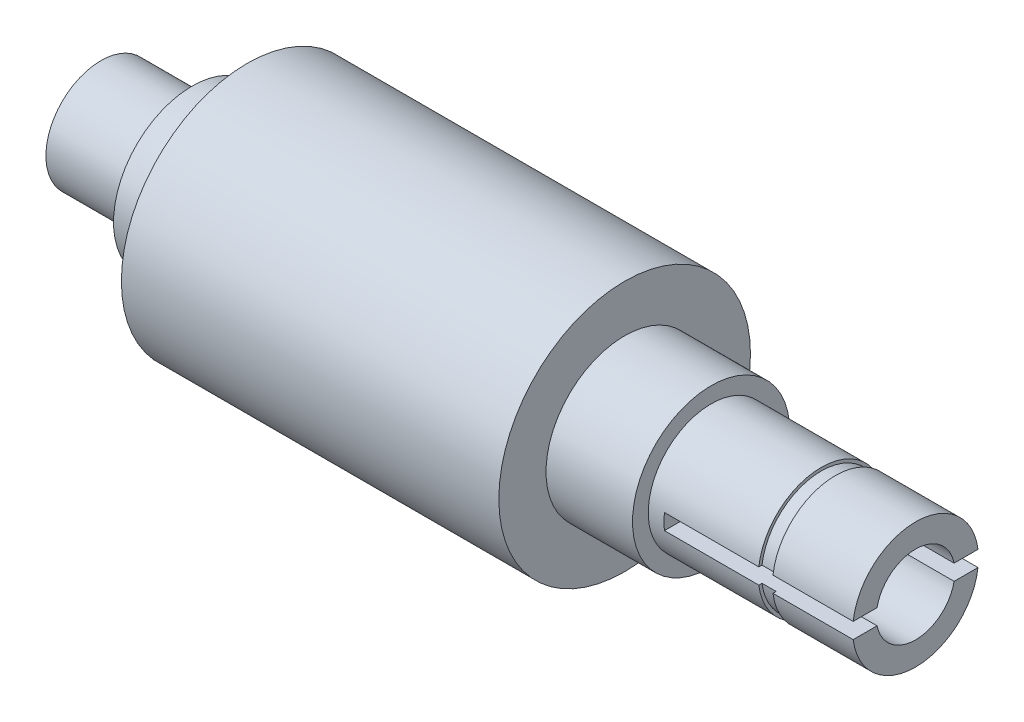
ISO-10303-21;
HEADER;
FILE_DESCRIPTION(('STEP AP214'),'2;1');
FILE_NAME('part.step','',(''),(''),'','','');
FILE_SCHEMA(('AUTOMOTIVE_DESIGN { 1 0 10303 214 1 1 1 1 }'));
ENDSEC;
DATA;
#1=APPLICATION_CONTEXT('core data for automotive mechanical design processes');
#2=APPLICATION_PROTOCOL_DEFINITION('international standard','automotive_design',2000,#1);
#3=PRODUCT_CONTEXT('',#1,'mechanical');
#4=PRODUCT('Part','Part','',(#3));
#5=PRODUCT_RELATED_PRODUCT_CATEGORY('part','',(#4));
#6=PRODUCT_DEFINITION_FORMATION('','',#4);
#7=PRODUCT_DEFINITION_CONTEXT('part definition',#1,'design');
#8=PRODUCT_DEFINITION('design','',#6,#7);
#9=PRODUCT_DEFINITION_SHAPE('','',#8);
#10=(LENGTH_UNIT() NAMED_UNIT(*) SI_UNIT(.MILLI.,.METRE.));
#11=(NAMED_UNIT(*) PLANE_ANGLE_UNIT() SI_UNIT($,.RADIAN.));
#12=(NAMED_UNIT(*) SI_UNIT($,.STERADIAN.) SOLID_ANGLE_UNIT());
#13=UNCERTAINTY_MEASURE_WITH_UNIT(LENGTH_MEASURE(1.E-05),#10,'distance_accuracy_value','');
#14=(GEOMETRIC_REPRESENTATION_CONTEXT(3) GLOBAL_UNCERTAINTY_ASSIGNED_CONTEXT((#13)) GLOBAL_UNIT_ASSIGNED_CONTEXT((#10,
#11,#12)) REPRESENTATION_CONTEXT('',''));
#15=CARTESIAN_POINT('',(0.,0.,0.));
#16=DIRECTION('',(0.,0.,1.));
#17=DIRECTION('',(1.,0.,0.));
#18=AXIS2_PLACEMENT_3D('',#15,#16,#17);
#19=CARTESIAN_POINT('',(0.,0.,1.66533453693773E-13));
#20=DIRECTION('',(1.,0.,0.));
#21=DIRECTION('',(0.,0.,-1.));
#22=AXIS2_PLACEMENT_3D('',#19,#20,#21);
#23=CYLINDRICAL_SURFACE('',#22,4.);
#24=CARTESIAN_POINT('',(-12.9999999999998,0.,1.66533453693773E-13));
#25=DIRECTION('',(1.,0.,0.));
#26=DIRECTION('',(0.,0.,-1.));
#27=AXIS2_PLACEMENT_3D('',#24,#25,#26);
#28=CIRCLE('',#27,4.);
#29=CARTESIAN_POINT('',(-12.9999999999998,0.,-3.99999999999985));
#30=VERTEX_POINT('',#29);
#31=EDGE_CURVE('E232',#30,#30,#28,.T.);
#32=ORIENTED_EDGE('',*,*,#31,.T.);
#33=EDGE_LOOP('',(#32));
#34=FACE_BOUND('',#33,.T.);
#35=DIRECTION('',(1.,0.,0.));
#36=VECTOR('',#35,1.);
#37=CARTESIAN_POINT('',(0.,-0.499999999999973,-3.96862696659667));
#38=LINE('',#37,#36);
#39=CARTESIAN_POINT('',(-5.99999999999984,-0.499999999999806,-3.96862696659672));
#40=VERTEX_POINT('',#39);
#41=CARTESIAN_POINT('',(-12.,-0.499999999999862,-3.96862696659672));
#42=VERTEX_POINT('',#41);
#43=EDGE_CURVE('E280',#40,#42,#38,.F.);
#44=ORIENTED_EDGE('',*,*,#43,.F.);
#45=CARTESIAN_POINT('',(-5.99999999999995,1.94289029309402E-13,1.66533453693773E-13));
#46=DIRECTION('',(1.,0.,0.));
#47=DIRECTION('',(0.,0.,-1.));
#48=AXIS2_PLACEMENT_3D('',#45,#46,#47);
#49=CIRCLE('',#48,4.);
#50=CARTESIAN_POINT('',(-5.99999999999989,-0.499999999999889,3.96862696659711));
#51=VERTEX_POINT('',#50);
#52=EDGE_CURVE('E184',#51,#40,#49,.T.);
#53=ORIENTED_EDGE('',*,*,#52,.F.);
#54=DIRECTION('',(1.,0.,0.));
#55=VECTOR('',#54,1.);
#56=CARTESIAN_POINT('',(0.,-0.499999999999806,3.96862696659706));
#57=LINE('',#56,#55);
#58=CARTESIAN_POINT('',(-11.9999999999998,-0.499999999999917,3.96862696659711));
#59=VERTEX_POINT('',#58);
#60=EDGE_CURVE('E271',#59,#51,#57,.T.);
#61=ORIENTED_EDGE('',*,*,#60,.F.);
#62=CARTESIAN_POINT('',(-12.,1.38777878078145E-13,2.22044604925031E-13));
#63=DIRECTION('',(-1.,0.,0.));
#64=DIRECTION('',(0.,0.,1.));
#65=AXIS2_PLACEMENT_3D('',#62,#63,#64);
#66=CIRCLE('',#65,4.);
#67=CARTESIAN_POINT('',(-12.,0.500000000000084,3.96862696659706));
#68=VERTEX_POINT('',#67);
#69=EDGE_CURVE('E274',#68,#59,#66,.F.);
#70=ORIENTED_EDGE('',*,*,#69,.F.);
#71=DIRECTION('',(1.,0.,0.));
#72=VECTOR('',#71,1.);
#73=CARTESIAN_POINT('',(1.11022302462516E-13,0.500000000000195,3.96862696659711));
#74=LINE('',#73,#72);
#75=CARTESIAN_POINT('',(-5.99999999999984,0.499999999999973,3.96862696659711));
#76=VERTEX_POINT('',#75);
#77=EDGE_CURVE('E277',#76,#68,#74,.F.);
#78=ORIENTED_EDGE('',*,*,#77,.F.);
#79=CARTESIAN_POINT('',(-5.99999999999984,0.500000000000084,-3.96862696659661));
#80=VERTEX_POINT('',#79);
#81=EDGE_CURVE('E293',#80,#76,#49,.T.);
#82=ORIENTED_EDGE('',*,*,#81,.F.);
#83=DIRECTION('',(1.,0.,0.));
#84=VECTOR('',#83,1.);
#85=CARTESIAN_POINT('',(0.,0.500000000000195,-3.96862696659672));
#86=LINE('',#85,#84);
#87=CARTESIAN_POINT('',(-12.,0.500000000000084,-3.96862696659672));
#88=VERTEX_POINT('',#87);
#89=EDGE_CURVE('E284',#88,#80,#86,.T.);
#90=ORIENTED_EDGE('',*,*,#89,.F.);
#91=EDGE_CURVE('E278',#42,#88,#66,.F.);
#92=ORIENTED_EDGE('',*,*,#91,.F.);
#93=EDGE_LOOP('',(#44,#53,#61,#70,#78,#82,#90,#92));
#94=FACE_BOUND('',#93,.T.);
#95=ADVANCED_FACE('F51',(#34,#94),#23,.T.);
#96=CARTESIAN_POINT('',(-5.09999999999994,2.4980018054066E-13,2.22044604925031E-13));
#97=DIRECTION('',(1.,0.,0.));
#98=DIRECTION('',(0.,0.,-1.));
#99=AXIS2_PLACEMENT_3D('',#96,#97,#98);
#100=CIRCLE('',#99,4.);
#101=CARTESIAN_POINT('',(-5.09999999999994,-0.499999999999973,3.96862696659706));
#102=VERTEX_POINT('',#101);
#103=CARTESIAN_POINT('',(-5.09999999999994,-0.499999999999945,-3.96862696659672));
#104=VERTEX_POINT('',#103);
#105=EDGE_CURVE('E301',#102,#104,#100,.T.);
#106=ORIENTED_EDGE('',*,*,#105,.T.);
#107=CARTESIAN_POINT('',(0.,-0.499999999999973,-3.96862696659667));
#108=VERTEX_POINT('',#107);
#109=EDGE_CURVE('E281',#108,#104,#38,.F.);
#110=ORIENTED_EDGE('',*,*,#109,.F.);
#111=CARTESIAN_POINT('',(0.,0.,1.66533453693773E-13));
#112=DIRECTION('',(1.,0.,0.));
#113=DIRECTION('',(0.,0.,-1.));
#114=AXIS2_PLACEMENT_3D('',#111,#112,#113);
#115=CIRCLE('',#114,4.);
#116=CARTESIAN_POINT('',(0.,-0.499999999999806,3.96862696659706));
#117=VERTEX_POINT('',#116);
#118=EDGE_CURVE('E235',#117,#108,#115,.T.);
#119=ORIENTED_EDGE('',*,*,#118,.F.);
#120=EDGE_CURVE('E270',#102,#117,#57,.T.);
#121=ORIENTED_EDGE('',*,*,#120,.F.);
#122=EDGE_LOOP('',(#106,#110,#119,#121));
#123=FACE_BOUND('',#122,.T.);
#124=ADVANCED_FACE('F331',(#123),#23,.T.);
#125=CARTESIAN_POINT('',(1.66533453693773E-13,2.50000000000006,1.66533453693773E-13));
#126=DIRECTION('',(1.,0.,0.));
#127=DIRECTION('',(0.,0.,-1.));
#128=AXIS2_PLACEMENT_3D('',#125,#126,#127);
#129=PLANE('',#128);
#130=DIRECTION('',(0.,0.,1.));
#131=VECTOR('',#130,1.);
#132=CARTESIAN_POINT('',(1.66533453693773E-13,0.499999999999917,-9.99999999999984));
#133=LINE('',#132,#131);
#134=CARTESIAN_POINT('',(0.,0.500000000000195,-3.96862696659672));
#135=VERTEX_POINT('',#134);
#136=CARTESIAN_POINT('',(0.,0.500000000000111,-2.44948974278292));
#137=VERTEX_POINT('',#136);
#138=EDGE_CURVE('E212',#135,#137,#133,.T.);
#139=ORIENTED_EDGE('',*,*,#138,.F.);
#140=CARTESIAN_POINT('',(1.11022302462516E-13,0.500000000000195,3.96862696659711));
#141=VERTEX_POINT('',#140);
#142=EDGE_CURVE('E236',#135,#141,#115,.T.);
#143=ORIENTED_EDGE('',*,*,#142,.T.);
#144=CARTESIAN_POINT('',(1.11022302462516E-13,0.500000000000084,2.44948974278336));
#145=VERTEX_POINT('',#144);
#146=EDGE_CURVE('E213',#145,#141,#133,.T.);
#147=ORIENTED_EDGE('',*,*,#146,.F.);
#148=CARTESIAN_POINT('',(0.,0.,1.66533453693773E-13));
#149=DIRECTION('',(1.,0.,0.));
#150=DIRECTION('',(0.,0.,-1.));
#151=AXIS2_PLACEMENT_3D('',#148,#149,#150);
#152=CIRCLE('',#151,2.5);
#153=EDGE_CURVE('E240',#137,#145,#152,.T.);
#154=ORIENTED_EDGE('',*,*,#153,.F.);
#155=EDGE_LOOP('',(#139,#143,#147,#154));
#156=FACE_BOUND('',#155,.T.);
#157=ADVANCED_FACE('F364',(#156),#129,.T.);
#158=CARTESIAN_POINT('',(-13.,5.00000000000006,1.66533453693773E-13));
#159=DIRECTION('',(1.,0.,0.));
#160=DIRECTION('',(0.,0.,-1.));
#161=AXIS2_PLACEMENT_3D('',#158,#159,#160);
#162=PLANE('',#161);
#163=CARTESIAN_POINT('',(-12.9999999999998,0.,1.66533453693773E-13));
#164=DIRECTION('',(1.,0.,0.));
#165=DIRECTION('',(0.,0.,-1.));
#166=AXIS2_PLACEMENT_3D('',#163,#164,#165);
#167=CIRCLE('',#166,5.);
#168=CARTESIAN_POINT('',(-12.9999999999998,0.,-4.99999999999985));
#169=VERTEX_POINT('',#168);
#170=EDGE_CURVE('E267',#169,#169,#167,.T.);
#171=ORIENTED_EDGE('',*,*,#170,.T.);
#172=EDGE_LOOP('',(#171));
#173=FACE_BOUND('',#172,.T.);
#174=ORIENTED_EDGE('',*,*,#31,.F.);
#175=EDGE_LOOP('',(#174));
#176=FACE_BOUND('',#175,.T.);
#177=ADVANCED_FACE('F53',(#173,#176),#162,.T.);
#178=CARTESIAN_POINT('',(0.,0.,1.66533453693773E-13));
#179=DIRECTION('',(1.,0.,0.));
#180=DIRECTION('',(0.,0.,-1.));
#181=AXIS2_PLACEMENT_3D('',#178,#179,#180);
#182=CYLINDRICAL_SURFACE('',#181,5.);
#183=CARTESIAN_POINT('',(-18.4999999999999,1.66533453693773E-13,1.66533453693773E-13));
#184=DIRECTION('',(1.,0.,0.));
#185=DIRECTION('',(0.,0.,-1.));
#186=AXIS2_PLACEMENT_3D('',#183,#184,#185);
#187=CIRCLE('',#186,5.);
#188=CARTESIAN_POINT('',(-18.4999999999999,1.66672231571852E-13,-4.99999999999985));
#189=VERTEX_POINT('',#188);
#190=EDGE_CURVE('E264',#189,#189,#187,.T.);
#191=ORIENTED_EDGE('',*,*,#190,.T.);
#192=EDGE_LOOP('',(#191));
#193=FACE_BOUND('',#192,.T.);
#194=ORIENTED_EDGE('',*,*,#170,.F.);
#195=EDGE_LOOP('',(#194));
#196=FACE_BOUND('',#195,.T.);
#197=ADVANCED_FACE('F385',(#193,#196),#182,.T.);
#198=CARTESIAN_POINT('',(-18.4999999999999,5.00000000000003,2.22044604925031E-13));
#199=DIRECTION('',(1.,0.,0.));
#200=DIRECTION('',(0.,0.,-1.));
#201=AXIS2_PLACEMENT_3D('',#198,#199,#200);
#202=PLANE('',#201);
#203=CARTESIAN_POINT('',(-18.4999999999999,1.66533453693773E-13,1.66533453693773E-13));
#204=DIRECTION('',(1.,0.,0.));
#205=DIRECTION('',(0.,0.,-1.));
#206=AXIS2_PLACEMENT_3D('',#203,#204,#205);
#207=CIRCLE('',#206,8.);
#208=CARTESIAN_POINT('',(-18.4999999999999,1.66755498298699E-13,-7.99999999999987));
#209=VERTEX_POINT('',#208);
#210=EDGE_CURVE('E261',#209,#209,#207,.T.);
#211=ORIENTED_EDGE('',*,*,#210,.T.);
#212=EDGE_LOOP('',(#211));
#213=FACE_BOUND('',#212,.T.);
#214=ORIENTED_EDGE('',*,*,#190,.F.);
#215=EDGE_LOOP('',(#214));
#216=FACE_BOUND('',#215,.T.);
#217=ADVANCED_FACE('F417',(#213,#216),#202,.T.);
#218=CARTESIAN_POINT('',(0.,0.,1.66533453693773E-13));
#219=DIRECTION('',(1.,0.,0.));
#220=DIRECTION('',(0.,0.,-1.));
#221=AXIS2_PLACEMENT_3D('',#218,#219,#220);
#222=CYLINDRICAL_SURFACE('',#221,8.);
#223=CARTESIAN_POINT('',(-42.4999999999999,0.,1.66533453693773E-13));
#224=DIRECTION('',(1.,0.,0.));
#225=DIRECTION('',(0.,0.,-1.));
#226=AXIS2_PLACEMENT_3D('',#223,#224,#225);
#227=CIRCLE('',#226,7.99999999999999);
#228=CARTESIAN_POINT('',(-42.4999999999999,0.,-7.99999999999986));
#229=VERTEX_POINT('',#228);
#230=EDGE_CURVE('E258',#229,#229,#227,.T.);
#231=ORIENTED_EDGE('',*,*,#230,.T.);
#232=EDGE_LOOP('',(#231));
#233=FACE_BOUND('',#232,.T.);
#234=ORIENTED_EDGE('',*,*,#210,.F.);
#235=EDGE_LOOP('',(#234));
#236=FACE_BOUND('',#235,.T.);
#237=ADVANCED_FACE('F413',(#233,#236),#222,.T.);
#238=CARTESIAN_POINT('',(-42.4999999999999,8.00000000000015,1.66533453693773E-13));
#239=DIRECTION('',(-1.,0.,0.));
#240=DIRECTION('',(0.,0.,1.));
#241=AXIS2_PLACEMENT_3D('',#238,#239,#240);
#242=PLANE('',#241);
#243=CARTESIAN_POINT('',(-42.4999999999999,0.,1.66533453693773E-13));
#244=DIRECTION('',(1.,0.,0.));
#245=DIRECTION('',(0.,0.,-1.));
#246=AXIS2_PLACEMENT_3D('',#243,#244,#245);
#247=CIRCLE('',#246,4.99999999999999);
#248=CARTESIAN_POINT('',(-42.4999999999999,0.,-4.99999999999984));
#249=VERTEX_POINT('',#248);
#250=EDGE_CURVE('E255',#249,#249,#247,.T.);
#251=ORIENTED_EDGE('',*,*,#250,.T.);
#252=EDGE_LOOP('',(#251));
#253=FACE_BOUND('',#252,.T.);
#254=ORIENTED_EDGE('',*,*,#230,.F.);
#255=EDGE_LOOP('',(#254));
#256=FACE_BOUND('',#255,.T.);
#257=ADVANCED_FACE('F409',(#253,#256),#242,.T.);
#258=CARTESIAN_POINT('',(0.,0.,1.66533453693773E-13));
#259=DIRECTION('',(1.,0.,0.));
#260=DIRECTION('',(0.,0.,-1.));
#261=AXIS2_PLACEMENT_3D('',#258,#259,#260);
#262=CYLINDRICAL_SURFACE('',#261,4.99999999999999);
#263=CARTESIAN_POINT('',(-45.9999999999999,0.,2.22044604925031E-13));
#264=DIRECTION('',(1.,0.,0.));
#265=DIRECTION('',(0.,0.,-1.));
#266=AXIS2_PLACEMENT_3D('',#263,#264,#265);
#267=CIRCLE('',#266,4.99999999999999);
#268=CARTESIAN_POINT('',(-45.9999999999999,0.,-4.99999999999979));
#269=VERTEX_POINT('',#268);
#270=EDGE_CURVE('E252',#269,#269,#267,.T.);
#271=ORIENTED_EDGE('',*,*,#270,.T.);
#272=EDGE_LOOP('',(#271));
#273=FACE_BOUND('',#272,.T.);
#274=ORIENTED_EDGE('',*,*,#250,.F.);
#275=EDGE_LOOP('',(#274));
#276=FACE_BOUND('',#275,.T.);
#277=ADVANCED_FACE('F405',(#273,#276),#262,.T.);
#278=CARTESIAN_POINT('',(-46.,5.00000000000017,2.22044604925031E-13));
#279=DIRECTION('',(-1.,0.,0.));
#280=DIRECTION('',(0.,0.,1.));
#281=AXIS2_PLACEMENT_3D('',#278,#279,#280);
#282=PLANE('',#281);
#283=CARTESIAN_POINT('',(-45.9999999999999,0.,2.22044604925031E-13));
#284=DIRECTION('',(1.,0.,0.));
#285=DIRECTION('',(0.,0.,-1.));
#286=AXIS2_PLACEMENT_3D('',#283,#284,#285);
#287=CIRCLE('',#286,3.49999999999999);
#288=CARTESIAN_POINT('',(-45.9999999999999,0.,-3.49999999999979));
#289=VERTEX_POINT('',#288);
#290=EDGE_CURVE('E249',#289,#289,#287,.T.);
#291=ORIENTED_EDGE('',*,*,#290,.T.);
#292=EDGE_LOOP('',(#291));
#293=FACE_BOUND('',#292,.T.);
#294=ORIENTED_EDGE('',*,*,#270,.F.);
#295=EDGE_LOOP('',(#294));
#296=FACE_BOUND('',#295,.T.);
#297=ADVANCED_FACE('F401',(#293,#296),#282,.T.);
#298=CARTESIAN_POINT('',(0.,0.,1.66533453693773E-13));
#299=DIRECTION('',(1.,0.,0.));
#300=DIRECTION('',(0.,0.,-1.));
#301=AXIS2_PLACEMENT_3D('',#298,#299,#300);
#302=CYLINDRICAL_SURFACE('',#301,3.49999999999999);
#303=CARTESIAN_POINT('',(-51.8,0.,2.22044604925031E-13));
#304=DIRECTION('',(1.,0.,0.));
#305=DIRECTION('',(0.,0.,-1.));
#306=AXIS2_PLACEMENT_3D('',#303,#304,#305);
#307=CIRCLE('',#306,3.49999999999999);
#308=CARTESIAN_POINT('',(-51.8,0.,-3.49999999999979));
#309=VERTEX_POINT('',#308);
#310=EDGE_CURVE('E246',#309,#309,#307,.T.);
#311=ORIENTED_EDGE('',*,*,#310,.T.);
#312=EDGE_LOOP('',(#311));
#313=FACE_BOUND('',#312,.T.);
#314=ORIENTED_EDGE('',*,*,#290,.F.);
#315=EDGE_LOOP('',(#314));
#316=FACE_BOUND('',#315,.T.);
#317=ADVANCED_FACE('F397',(#313,#316),#302,.T.);
#318=CARTESIAN_POINT('',(-51.7999999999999,3.50000000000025,2.77555756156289E-13));
#319=DIRECTION('',(-1.,0.,0.));
#320=DIRECTION('',(0.,0.,1.));
#321=AXIS2_PLACEMENT_3D('',#318,#319,#320);
#322=PLANE('',#321);
#323=CARTESIAN_POINT('',(-51.8,0.,2.22044604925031E-13));
#324=DIRECTION('',(-1.,0.,0.));
#325=DIRECTION('',(0.,0.,1.));
#326=AXIS2_PLACEMENT_3D('',#323,#324,#325);
#327=CIRCLE('',#326,2.5);
#328=CARTESIAN_POINT('',(-51.8,0.,2.50000000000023));
#329=VERTEX_POINT('',#328);
#330=EDGE_CURVE('E204',#329,#329,#327,.T.);
#331=ORIENTED_EDGE('',*,*,#330,.F.);
#332=EDGE_LOOP('',(#331));
#333=FACE_BOUND('',#332,.T.);
#334=ORIENTED_EDGE('',*,*,#310,.F.);
#335=EDGE_LOOP('',(#334));
#336=FACE_BOUND('',#335,.T.);
#337=ADVANCED_FACE('F393',(#333,#336),#322,.T.);
#338=CARTESIAN_POINT('',(-16.443375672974,0.,1.66533453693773E-13));
#339=DIRECTION('',(1.,0.,0.));
#340=DIRECTION('',(0.,0.,-1.));
#341=AXIS2_PLACEMENT_3D('',#338,#339,#340);
#342=CONICAL_SURFACE('',#341,0.,1.0471975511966);
#343=CARTESIAN_POINT('',(-15.,1.11022302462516E-13,3.33066907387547E-13));
#344=DIRECTION('',(1.,0.,0.));
#345=DIRECTION('',(0.,0.,-1.));
#346=AXIS2_PLACEMENT_3D('',#343,#344,#345);
#347=CIRCLE('',#346,2.5);
#348=CARTESIAN_POINT('',(-15.,1.11091691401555E-13,-2.49999999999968));
#349=VERTEX_POINT('',#348);
#350=EDGE_CURVE('E243',#349,#349,#347,.T.);
#351=ORIENTED_EDGE('',*,*,#350,.T.);
#352=EDGE_LOOP('',(#351));
#353=FACE_BOUND('',#352,.T.);
#354=CARTESIAN_POINT('',(-16.443375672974,0.,1.66533453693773E-13));
#355=VERTEX_POINT('',#354);
#356=VERTEX_LOOP('',#355);
#357=FACE_BOUND('',#356,.T.);
#358=ADVANCED_FACE('F390',(#353,#357),#342,.F.);
#359=CARTESIAN_POINT('',(0.,0.,1.66533453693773E-13));
#360=DIRECTION('',(1.,0.,0.));
#361=DIRECTION('',(0.,0.,-1.));
#362=AXIS2_PLACEMENT_3D('',#359,#360,#361);
#363=CYLINDRICAL_SURFACE('',#362,2.5);
#364=DIRECTION('',(1.,0.,0.));
#365=VECTOR('',#364,1.);
#366=CARTESIAN_POINT('',(0.,0.500000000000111,-2.44948974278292));
#367=LINE('',#366,#365);
#368=CARTESIAN_POINT('',(-11.9999999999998,0.500000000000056,-2.44948974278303));
#369=VERTEX_POINT('',#368);
#370=EDGE_CURVE('E225',#137,#369,#367,.F.);
#371=ORIENTED_EDGE('',*,*,#370,.F.);
#372=ORIENTED_EDGE('',*,*,#153,.T.);
#373=DIRECTION('',(1.,0.,0.));
#374=VECTOR('',#373,1.);
#375=CARTESIAN_POINT('',(1.11022302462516E-13,0.500000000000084,2.44948974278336));
#376=LINE('',#375,#374);
#377=CARTESIAN_POINT('',(-12.,0.500000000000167,2.44948974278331));
#378=VERTEX_POINT('',#377);
#379=EDGE_CURVE('E227',#378,#145,#376,.T.);
#380=ORIENTED_EDGE('',*,*,#379,.F.);
#381=CARTESIAN_POINT('',(-12.,1.38777878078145E-13,2.22044604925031E-13));
#382=DIRECTION('',(-1.,0.,0.));
#383=DIRECTION('',(0.,0.,1.));
#384=AXIS2_PLACEMENT_3D('',#381,#382,#383);
#385=CIRCLE('',#384,2.5);
#386=CARTESIAN_POINT('',(-12.,-0.499999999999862,2.44948974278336));
#387=VERTEX_POINT('',#386);
#388=EDGE_CURVE('E229',#387,#378,#385,.T.);
#389=ORIENTED_EDGE('',*,*,#388,.F.);
#390=DIRECTION('',(1.,0.,0.));
#391=VECTOR('',#390,1.);
#392=CARTESIAN_POINT('',(0.,-0.499999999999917,2.44948974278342));
#393=LINE('',#392,#391);
#394=CARTESIAN_POINT('',(0.,-0.499999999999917,2.44948974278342));
#395=VERTEX_POINT('',#394);
#396=EDGE_CURVE('E221',#395,#387,#393,.F.);
#397=ORIENTED_EDGE('',*,*,#396,.F.);
#398=CARTESIAN_POINT('',(1.11022302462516E-13,-0.499999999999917,-2.44948974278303));
#399=VERTEX_POINT('',#398);
#400=EDGE_CURVE('E239',#395,#399,#152,.T.);
#401=ORIENTED_EDGE('',*,*,#400,.T.);
#402=DIRECTION('',(1.,0.,0.));
#403=VECTOR('',#402,1.);
#404=CARTESIAN_POINT('',(1.66533453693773E-13,-0.499999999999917,-2.44948974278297));
#405=LINE('',#404,#403);
#406=CARTESIAN_POINT('',(-11.9999999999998,-0.499999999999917,-2.44948974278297));
#407=VERTEX_POINT('',#406);
#408=EDGE_CURVE('E223',#407,#399,#405,.T.);
#409=ORIENTED_EDGE('',*,*,#408,.F.);
#410=EDGE_CURVE('E231',#369,#407,#385,.T.);
#411=ORIENTED_EDGE('',*,*,#410,.F.);
#412=EDGE_LOOP('',(#371,#372,#380,#389,#397,#401,#409,#411));
#413=FACE_BOUND('',#412,.T.);
#414=ORIENTED_EDGE('',*,*,#350,.F.);
#415=EDGE_LOOP('',(#414));
#416=FACE_BOUND('',#415,.T.);
#417=ADVANCED_FACE('F314',(#413,#416),#363,.F.);
#418=DIRECTION('',(0.,0.,1.));
#419=VECTOR('',#418,1.);
#420=CARTESIAN_POINT('',(1.11022302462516E-13,-0.499999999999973,-9.99999999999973));
#421=LINE('',#420,#419);
#422=EDGE_CURVE('E216',#395,#117,#421,.T.);
#423=ORIENTED_EDGE('',*,*,#422,.T.);
#424=ORIENTED_EDGE('',*,*,#118,.T.);
#425=EDGE_CURVE('E215',#108,#399,#421,.T.);
#426=ORIENTED_EDGE('',*,*,#425,.T.);
#427=ORIENTED_EDGE('',*,*,#400,.F.);
#428=EDGE_LOOP('',(#423,#424,#426,#427));
#429=FACE_BOUND('',#428,.T.);
#430=ADVANCED_FACE('F326',(#429),#129,.T.);
#431=CARTESIAN_POINT('',(-5.09999999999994,0.500000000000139,-3.96862696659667));
#432=VERTEX_POINT('',#431);
#433=CARTESIAN_POINT('',(-5.09999999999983,0.500000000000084,3.96862696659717));
#434=VERTEX_POINT('',#433);
#435=EDGE_CURVE('E347',#432,#434,#100,.T.);
#436=ORIENTED_EDGE('',*,*,#435,.T.);
#437=EDGE_CURVE('E190',#141,#434,#74,.F.);
#438=ORIENTED_EDGE('',*,*,#437,.F.);
#439=ORIENTED_EDGE('',*,*,#142,.F.);
#440=EDGE_CURVE('E288',#432,#135,#86,.T.);
#441=ORIENTED_EDGE('',*,*,#440,.F.);
#442=EDGE_LOOP('',(#436,#438,#439,#441));
#443=FACE_BOUND('',#442,.T.);
#444=ADVANCED_FACE('F366',(#443),#23,.T.);
#445=CARTESIAN_POINT('',(-11.9999999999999,0.500000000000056,-9.99999999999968));
#446=DIRECTION('',(0.,1.,0.));
#447=DIRECTION('',(0.,0.,1.));
#448=AXIS2_PLACEMENT_3D('',#445,#446,#447);
#449=PLANE('',#448);
#450=ORIENTED_EDGE('',*,*,#437,.T.);
#451=DIRECTION('',(0.,0.,-1.));
#452=VECTOR('',#451,1.);
#453=CARTESIAN_POINT('',(-5.09999999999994,0.499999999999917,-9.99999999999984));
#454=LINE('',#453,#452);
#455=CARTESIAN_POINT('',(-5.09999999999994,0.500000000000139,3.76696164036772));
#456=VERTEX_POINT('',#455);
#457=EDGE_CURVE('E181',#434,#456,#454,.T.);
#458=ORIENTED_EDGE('',*,*,#457,.T.);
#459=DIRECTION('',(-1.,0.,0.));
#460=VECTOR('',#459,1.);
#461=CARTESIAN_POINT('',(-5.09999999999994,0.500000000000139,3.76696164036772));
#462=LINE('',#461,#460);
#463=CARTESIAN_POINT('',(-5.99999999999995,0.500000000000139,3.76696164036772));
#464=VERTEX_POINT('',#463);
#465=EDGE_CURVE('E169',#456,#464,#462,.T.);
#466=ORIENTED_EDGE('',*,*,#465,.T.);
#467=DIRECTION('',(0.,0.,-1.));
#468=VECTOR('',#467,1.);
#469=CARTESIAN_POINT('',(-5.99999999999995,0.5,-9.99999999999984));
#470=LINE('',#469,#468);
#471=EDGE_CURVE('E338',#76,#464,#470,.T.);
#472=ORIENTED_EDGE('',*,*,#471,.F.);
#473=ORIENTED_EDGE('',*,*,#77,.T.);
#474=DIRECTION('',(0.,0.,1.));
#475=VECTOR('',#474,1.);
#476=CARTESIAN_POINT('',(-11.9999999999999,0.500000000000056,-9.99999999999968));
#477=LINE('',#476,#475);
#478=EDGE_CURVE('E208',#378,#68,#477,.T.);
#479=ORIENTED_EDGE('',*,*,#478,.F.);
#480=ORIENTED_EDGE('',*,*,#379,.T.);
#481=ORIENTED_EDGE('',*,*,#146,.T.);
#482=EDGE_LOOP('',(#450,#458,#466,#472,#473,#479,#480,#481));
#483=FACE_BOUND('',#482,.T.);
#484=ADVANCED_FACE('F188',(#483),#449,.F.);
#485=CARTESIAN_POINT('',(-11.9999999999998,-0.500000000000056,-9.99999999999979));
#486=DIRECTION('',(0.,-1.,0.));
#487=DIRECTION('',(0.,0.,-1.));
#488=AXIS2_PLACEMENT_3D('',#485,#486,#487);
#489=PLANE('',#488);
#490=DIRECTION('',(-1.,0.,0.));
#491=VECTOR('',#490,1.);
#492=CARTESIAN_POINT('',(-5.09999999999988,-0.499999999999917,3.76696164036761));
#493=LINE('',#492,#491);
#494=CARTESIAN_POINT('',(-5.99999999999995,-0.499999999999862,3.76696164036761));
#495=VERTEX_POINT('',#494);
#496=CARTESIAN_POINT('',(-5.09999999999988,-0.499999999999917,3.76696164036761));
#497=VERTEX_POINT('',#496);
#498=EDGE_CURVE('E177',#495,#497,#493,.F.);
#499=ORIENTED_EDGE('',*,*,#498,.T.);
#500=DIRECTION('',(0.,0.,1.));
#501=VECTOR('',#500,1.);
#502=CARTESIAN_POINT('',(-5.09999999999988,-0.500000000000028,-9.99999999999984));
#503=LINE('',#502,#501);
#504=EDGE_CURVE('E192',#497,#102,#503,.T.);
#505=ORIENTED_EDGE('',*,*,#504,.T.);
#506=ORIENTED_EDGE('',*,*,#120,.T.);
#507=ORIENTED_EDGE('',*,*,#422,.F.);
#508=ORIENTED_EDGE('',*,*,#396,.T.);
#509=DIRECTION('',(0.,0.,1.));
#510=VECTOR('',#509,1.);
#511=CARTESIAN_POINT('',(-11.9999999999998,-0.500000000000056,-9.99999999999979));
#512=LINE('',#511,#510);
#513=EDGE_CURVE('E207',#387,#59,#512,.T.);
#514=ORIENTED_EDGE('',*,*,#513,.T.);
#515=ORIENTED_EDGE('',*,*,#60,.T.);
#516=DIRECTION('',(0.,0.,1.));
#517=VECTOR('',#516,1.);
#518=CARTESIAN_POINT('',(-6.00000000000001,-0.499999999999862,-9.99999999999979));
#519=LINE('',#518,#517);
#520=EDGE_CURVE('E339',#495,#51,#519,.T.);
#521=ORIENTED_EDGE('',*,*,#520,.F.);
#522=EDGE_LOOP('',(#499,#505,#506,#507,#508,#514,#515,#521));
#523=FACE_BOUND('',#522,.T.);
#524=ADVANCED_FACE('F354',(#523),#489,.F.);
#525=CARTESIAN_POINT('',(-11.9999999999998,-0.500000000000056,-9.99999999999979));
#526=DIRECTION('',(-1.,0.,0.));
#527=DIRECTION('',(0.,0.,1.));
#528=AXIS2_PLACEMENT_3D('',#525,#526,#527);
#529=PLANE('',#528);
#530=ORIENTED_EDGE('',*,*,#388,.T.);
#531=ORIENTED_EDGE('',*,*,#478,.T.);
#532=ORIENTED_EDGE('',*,*,#69,.T.);
#533=ORIENTED_EDGE('',*,*,#513,.F.);
#534=EDGE_LOOP('',(#530,#531,#532,#533));
#535=FACE_BOUND('',#534,.T.);
#536=ADVANCED_FACE('F496',(#535),#529,.F.);
#537=ORIENTED_EDGE('',*,*,#410,.T.);
#538=EDGE_CURVE('E219',#42,#407,#512,.T.);
#539=ORIENTED_EDGE('',*,*,#538,.F.);
#540=ORIENTED_EDGE('',*,*,#91,.T.);
#541=EDGE_CURVE('E211',#88,#369,#477,.T.);
#542=ORIENTED_EDGE('',*,*,#541,.T.);
#543=EDGE_LOOP('',(#537,#539,#540,#542));
#544=FACE_BOUND('',#543,.T.);
#545=ADVANCED_FACE('F309',(#544),#529,.F.);
#546=ORIENTED_EDGE('',*,*,#109,.T.);
#547=DIRECTION('',(0.,0.,1.));
#548=VECTOR('',#547,1.);
#549=CARTESIAN_POINT('',(-5.09999999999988,-0.500000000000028,-9.99999999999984));
#550=LINE('',#549,#548);
#551=CARTESIAN_POINT('',(-5.09999999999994,-0.499999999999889,-3.76696164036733));
#552=VERTEX_POINT('',#551);
#553=EDGE_CURVE('E198',#104,#552,#550,.T.);
#554=ORIENTED_EDGE('',*,*,#553,.T.);
#555=DIRECTION('',(-1.,0.,0.));
#556=VECTOR('',#555,1.);
#557=CARTESIAN_POINT('',(-5.09999999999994,-0.499999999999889,-3.76696164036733));
#558=LINE('',#557,#556);
#559=CARTESIAN_POINT('',(-5.99999999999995,-0.499999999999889,-3.76696164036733));
#560=VERTEX_POINT('',#559);
#561=EDGE_CURVE('E335',#552,#560,#558,.T.);
#562=ORIENTED_EDGE('',*,*,#561,.T.);
#563=DIRECTION('',(0.,0.,1.));
#564=VECTOR('',#563,1.);
#565=CARTESIAN_POINT('',(-6.00000000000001,-0.499999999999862,-9.99999999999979));
#566=LINE('',#565,#564);
#567=EDGE_CURVE('E176',#40,#560,#566,.T.);
#568=ORIENTED_EDGE('',*,*,#567,.F.);
#569=ORIENTED_EDGE('',*,*,#43,.T.);
#570=ORIENTED_EDGE('',*,*,#538,.T.);
#571=ORIENTED_EDGE('',*,*,#408,.T.);
#572=ORIENTED_EDGE('',*,*,#425,.F.);
#573=EDGE_LOOP('',(#546,#554,#562,#568,#569,#570,#571,#572));
#574=FACE_BOUND('',#573,.T.);
#575=ADVANCED_FACE('F322',(#574),#489,.F.);
#576=DIRECTION('',(-1.,0.,0.));
#577=VECTOR('',#576,1.);
#578=CARTESIAN_POINT('',(-5.09999999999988,0.500000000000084,-3.76696164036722));
#579=LINE('',#578,#577);
#580=CARTESIAN_POINT('',(-5.99999999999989,0.500000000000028,-3.76696164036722));
#581=VERTEX_POINT('',#580);
#582=CARTESIAN_POINT('',(-5.09999999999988,0.500000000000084,-3.76696164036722));
#583=VERTEX_POINT('',#582);
#584=EDGE_CURVE('E287',#581,#583,#579,.F.);
#585=ORIENTED_EDGE('',*,*,#584,.T.);
#586=DIRECTION('',(0.,0.,-1.));
#587=VECTOR('',#586,1.);
#588=CARTESIAN_POINT('',(-5.09999999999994,0.499999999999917,-9.99999999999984));
#589=LINE('',#588,#587);
#590=EDGE_CURVE('E12',#583,#432,#589,.T.);
#591=ORIENTED_EDGE('',*,*,#590,.T.);
#592=ORIENTED_EDGE('',*,*,#440,.T.);
#593=ORIENTED_EDGE('',*,*,#138,.T.);
#594=ORIENTED_EDGE('',*,*,#370,.T.);
#595=ORIENTED_EDGE('',*,*,#541,.F.);
#596=ORIENTED_EDGE('',*,*,#89,.T.);
#597=DIRECTION('',(0.,0.,-1.));
#598=VECTOR('',#597,1.);
#599=CARTESIAN_POINT('',(-5.99999999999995,0.5,-9.99999999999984));
#600=LINE('',#599,#598);
#601=EDGE_CURVE('E59',#581,#80,#600,.T.);
#602=ORIENTED_EDGE('',*,*,#601,.F.);
#603=EDGE_LOOP('',(#585,#591,#592,#593,#594,#595,#596,#602));
#604=FACE_BOUND('',#603,.T.);
#605=ADVANCED_FACE('F304',(#604),#449,.F.);
#606=CARTESIAN_POINT('',(-51.8,0.,2.22044604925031E-13));
#607=DIRECTION('',(-1.,0.,0.));
#608=DIRECTION('',(0.,0.,1.));
#609=AXIS2_PLACEMENT_3D('',#606,#607,#608);
#610=CONICAL_SURFACE('',#609,2.5,0.785398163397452);
#611=CARTESIAN_POINT('',(-51.3999999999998,1.38777878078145E-13,2.22044604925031E-13));
#612=DIRECTION('',(-1.,0.,0.));
#613=DIRECTION('',(0.,0.,1.));
#614=AXIS2_PLACEMENT_3D('',#611,#612,#613);
#615=CIRCLE('',#614,2.1);
#616=CARTESIAN_POINT('',(-51.3999999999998,1.38719591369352E-13,2.10000000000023));
#617=VERTEX_POINT('',#616);
#618=EDGE_CURVE('E195',#617,#617,#615,.T.);
#619=ORIENTED_EDGE('',*,*,#618,.F.);
#620=EDGE_LOOP('',(#619));
#621=FACE_BOUND('',#620,.T.);
#622=ORIENTED_EDGE('',*,*,#330,.T.);
#623=EDGE_LOOP('',(#622));
#624=FACE_BOUND('',#623,.T.);
#625=ADVANCED_FACE('F527',(#621,#624),#610,.F.);
#626=CARTESIAN_POINT('',(-51.8,0.,2.22044604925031E-13));
#627=DIRECTION('',(-1.,0.,0.));
#628=DIRECTION('',(0.,0.,1.));
#629=AXIS2_PLACEMENT_3D('',#626,#627,#628);
#630=CYLINDRICAL_SURFACE('',#629,2.1);
#631=CARTESIAN_POINT('',(-39.3999999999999,1.38777878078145E-13,1.66533453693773E-13));
#632=DIRECTION('',(-1.,0.,0.));
#633=DIRECTION('',(0.,0.,1.));
#634=AXIS2_PLACEMENT_3D('',#631,#632,#633);
#635=CIRCLE('',#634,2.1);
#636=CARTESIAN_POINT('',(-39.3999999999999,1.38719591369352E-13,2.10000000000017));
#637=VERTEX_POINT('',#636);
#638=EDGE_CURVE('E191',#637,#637,#635,.T.);
#639=ORIENTED_EDGE('',*,*,#638,.F.);
#640=EDGE_LOOP('',(#639));
#641=FACE_BOUND('',#640,.T.);
#642=ORIENTED_EDGE('',*,*,#618,.T.);
#643=EDGE_LOOP('',(#642));
#644=FACE_BOUND('',#643,.T.);
#645=ADVANCED_FACE('F535',(#641,#644),#630,.F.);
#646=CARTESIAN_POINT('',(-39.3999999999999,1.38777878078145E-13,1.66533453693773E-13));
#647=DIRECTION('',(-1.,0.,0.));
#648=DIRECTION('',(0.,0.,1.));
#649=AXIS2_PLACEMENT_3D('',#646,#647,#648);
#650=CONICAL_SURFACE('',#649,2.1,1.0471975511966);
#651=CARTESIAN_POINT('',(-38.1875644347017,1.38777878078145E-13,1.66533453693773E-13));
#652=VERTEX_POINT('',#651);
#653=VERTEX_LOOP('',#652);
#654=FACE_BOUND('',#653,.T.);
#655=ORIENTED_EDGE('',*,*,#638,.T.);
#656=EDGE_LOOP('',(#655));
#657=FACE_BOUND('',#656,.T.);
#658=ADVANCED_FACE('F545',(#654,#657),#650,.F.);
#659=CARTESIAN_POINT('',(-5.09999999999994,2.4980018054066E-13,2.22044604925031E-13));
#660=DIRECTION('',(-1.,0.,0.));
#661=DIRECTION('',(0.,0.,1.));
#662=AXIS2_PLACEMENT_3D('',#659,#660,#661);
#663=CYLINDRICAL_SURFACE('',#662,3.8);
#664=CARTESIAN_POINT('',(-5.09999999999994,2.4980018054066E-13,2.22044604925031E-13));
#665=DIRECTION('',(1.,0.,0.));
#666=DIRECTION('',(0.,0.,-1.));
#667=AXIS2_PLACEMENT_3D('',#664,#665,#666);
#668=CIRCLE('',#667,3.8);
#669=EDGE_CURVE('E74',#583,#456,#668,.T.);
#670=ORIENTED_EDGE('',*,*,#669,.F.);
#671=ORIENTED_EDGE('',*,*,#584,.F.);
#672=CARTESIAN_POINT('',(-5.99999999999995,1.94289029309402E-13,1.66533453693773E-13));
#673=DIRECTION('',(1.,0.,0.));
#674=DIRECTION('',(0.,0.,-1.));
#675=AXIS2_PLACEMENT_3D('',#672,#673,#674);
#676=CIRCLE('',#675,3.8);
#677=EDGE_CURVE('E172',#581,#464,#676,.T.);
#678=ORIENTED_EDGE('',*,*,#677,.T.);
#679=ORIENTED_EDGE('',*,*,#465,.F.);
#680=EDGE_LOOP('',(#670,#671,#678,#679));
#681=FACE_BOUND('',#680,.T.);
#682=ADVANCED_FACE('F170',(#681),#663,.T.);
#683=CARTESIAN_POINT('',(-5.99999999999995,1.94289029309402E-13,1.66533453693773E-13));
#684=DIRECTION('',(1.,0.,0.));
#685=DIRECTION('',(0.,0.,-1.));
#686=AXIS2_PLACEMENT_3D('',#683,#684,#685);
#687=PLANE('',#686);
#688=ORIENTED_EDGE('',*,*,#471,.T.);
#689=ORIENTED_EDGE('',*,*,#677,.F.);
#690=ORIENTED_EDGE('',*,*,#601,.T.);
#691=ORIENTED_EDGE('',*,*,#81,.T.);
#692=EDGE_LOOP('',(#688,#689,#690,#691));
#693=FACE_BOUND('',#692,.T.);
#694=ADVANCED_FACE('F292',(#693),#687,.T.);
#695=CARTESIAN_POINT('',(-5.09999999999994,2.4980018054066E-13,2.22044604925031E-13));
#696=DIRECTION('',(1.,0.,0.));
#697=DIRECTION('',(0.,0.,-1.));
#698=AXIS2_PLACEMENT_3D('',#695,#696,#697);
#699=PLANE('',#698);
#700=ORIENTED_EDGE('',*,*,#435,.F.);
#701=ORIENTED_EDGE('',*,*,#590,.F.);
#702=ORIENTED_EDGE('',*,*,#669,.T.);
#703=ORIENTED_EDGE('',*,*,#457,.F.);
#704=EDGE_LOOP('',(#700,#701,#702,#703));
#705=FACE_BOUND('',#704,.T.);
#706=ADVANCED_FACE('F180',(#705),#699,.F.);
#707=EDGE_CURVE('E185',#497,#552,#668,.T.);
#708=ORIENTED_EDGE('',*,*,#707,.T.);
#709=ORIENTED_EDGE('',*,*,#553,.F.);
#710=ORIENTED_EDGE('',*,*,#105,.F.);
#711=ORIENTED_EDGE('',*,*,#504,.F.);
#712=EDGE_LOOP('',(#708,#709,#710,#711));
#713=FACE_BOUND('',#712,.T.);
#714=ADVANCED_FACE('F350',(#713),#699,.F.);
#715=ORIENTED_EDGE('',*,*,#520,.T.);
#716=ORIENTED_EDGE('',*,*,#52,.T.);
#717=ORIENTED_EDGE('',*,*,#567,.T.);
#718=EDGE_CURVE('E66',#495,#560,#676,.T.);
#719=ORIENTED_EDGE('',*,*,#718,.F.);
#720=EDGE_LOOP('',(#715,#716,#717,#719));
#721=FACE_BOUND('',#720,.T.);
#722=ADVANCED_FACE('F358',(#721),#687,.T.);
#723=ORIENTED_EDGE('',*,*,#718,.T.);
#724=ORIENTED_EDGE('',*,*,#561,.F.);
#725=ORIENTED_EDGE('',*,*,#707,.F.);
#726=ORIENTED_EDGE('',*,*,#498,.F.);
#727=EDGE_LOOP('',(#723,#724,#725,#726));
#728=FACE_BOUND('',#727,.T.);
#729=ADVANCED_FACE('F351',(#728),#663,.T.);
#730=CLOSED_SHELL('',(#95,#124,#157,#177,#197,#217,#237,#257,#277,#297,#317,#337,#358,#417,#430,
#444,#484,#524,#536,#545,#575,#605,#625,#645,#658,#682,#694,#706,#714,#722,#729));
#731=MANIFOLD_SOLID_BREP('B2',#730);
#732=ADVANCED_BREP_SHAPE_REPRESENTATION('',(#18,#731),#14);
#733=SHAPE_DEFINITION_REPRESENTATION(#9,#732);
ENDSEC;
END-ISO-10303-21;
